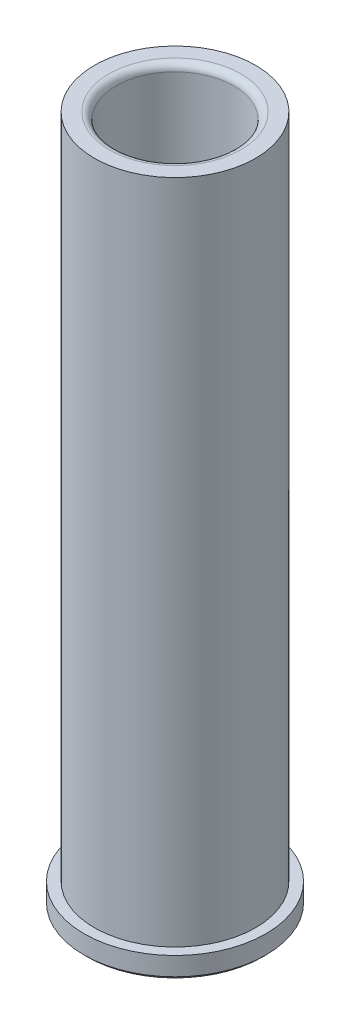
from build123d import *

# Parameters (mm, degrees)
FILLET1_R = 1.524


with BuildPart() as part:
    # Sketch1 → Revolve1 (revolve)
    with BuildSketch(Plane.XY, mode=Mode.PRIVATE) as revolve1_sk:
        Polygon((-18.9484, 0), (-19.7104, 0.762), (-19.7104, 4.7625), (-17.46885, 4.7625), (-17.46885, 149.225), (-12.7635, 149.225), (-12.7635, 0.762), (-13.5255, 0), align=None)
    revolve(revolve1_sk.sketch.rotate(Axis((0, -1000, 0), (0, 1, 0)), 180), axis=Axis((0, -1000, 0), (0, 1, 0)))

    # Fillet1
    fillet1_edges = [part.edges().sort_by_distance(p)[0] for p in [
        (-12.7635, 149.225, 0),
    ]]
    fillet(fillet1_edges, radius=FILLET1_R)


solid = part.part
